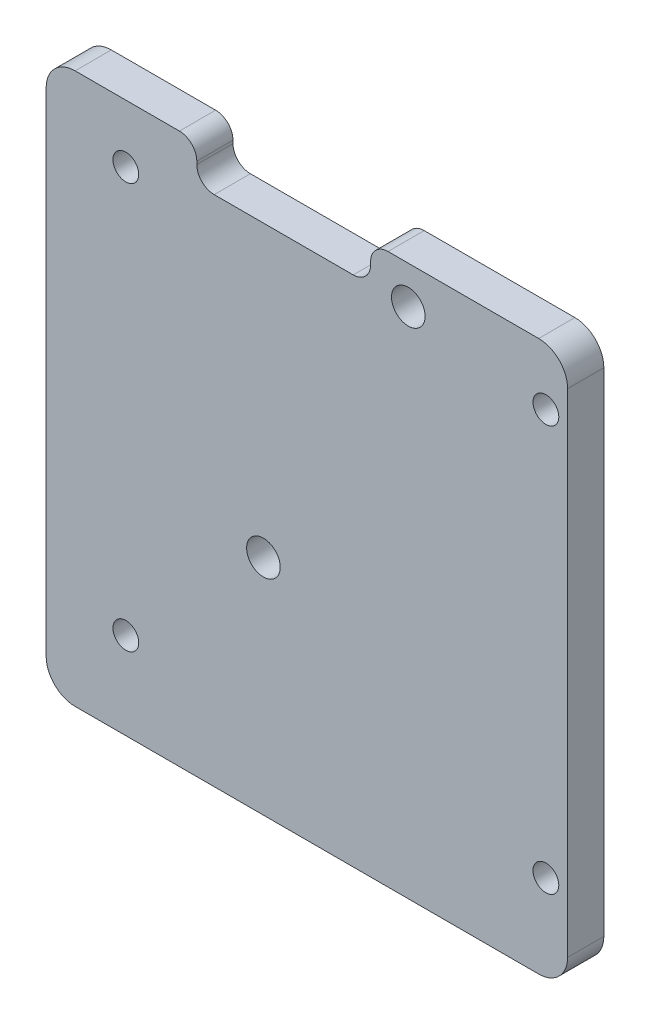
ISO-10303-21;
HEADER;
FILE_DESCRIPTION(('STEP AP214'),'2;1');
FILE_NAME('part.step','',(''),(''),'','','');
FILE_SCHEMA(('AUTOMOTIVE_DESIGN { 1 0 10303 214 1 1 1 1 }'));
ENDSEC;
DATA;
#1=APPLICATION_CONTEXT('core data for automotive mechanical design processes');
#2=APPLICATION_PROTOCOL_DEFINITION('international standard','automotive_design',2000,#1);
#3=PRODUCT_CONTEXT('',#1,'mechanical');
#4=PRODUCT('Part','Part','',(#3));
#5=PRODUCT_RELATED_PRODUCT_CATEGORY('part','',(#4));
#6=PRODUCT_DEFINITION_FORMATION('','',#4);
#7=PRODUCT_DEFINITION_CONTEXT('part definition',#1,'design');
#8=PRODUCT_DEFINITION('design','',#6,#7);
#9=PRODUCT_DEFINITION_SHAPE('','',#8);
#10=(LENGTH_UNIT() NAMED_UNIT(*) SI_UNIT(.MILLI.,.METRE.));
#11=(NAMED_UNIT(*) PLANE_ANGLE_UNIT() SI_UNIT($,.RADIAN.));
#12=(NAMED_UNIT(*) SI_UNIT($,.STERADIAN.) SOLID_ANGLE_UNIT());
#13=UNCERTAINTY_MEASURE_WITH_UNIT(LENGTH_MEASURE(1.E-05),#10,'distance_accuracy_value','');
#14=(GEOMETRIC_REPRESENTATION_CONTEXT(3) GLOBAL_UNCERTAINTY_ASSIGNED_CONTEXT((#13)) GLOBAL_UNIT_ASSIGNED_CONTEXT((#10,
#11,#12)) REPRESENTATION_CONTEXT('',''));
#15=CARTESIAN_POINT('',(0.,0.,0.));
#16=DIRECTION('',(0.,0.,1.));
#17=DIRECTION('',(1.,0.,0.));
#18=AXIS2_PLACEMENT_3D('',#15,#16,#17);
#19=CARTESIAN_POINT('',(-22.86,24.13,3.175));
#20=DIRECTION('',(0.,-1.,0.));
#21=DIRECTION('',(0.,0.,-1.));
#22=AXIS2_PLACEMENT_3D('',#19,#20,#21);
#23=PLANE('',#22);
#24=DIRECTION('',(-1.,0.,0.));
#25=VECTOR('',#24,1.);
#26=CARTESIAN_POINT('',(-22.86,24.13,0.));
#27=LINE('',#26,#25);
#28=CARTESIAN_POINT('',(-11.176,24.13,0.));
#29=VERTEX_POINT('',#28);
#30=CARTESIAN_POINT('',(-20.32,24.13,0.));
#31=VERTEX_POINT('',#30);
#32=EDGE_CURVE('E167',#29,#31,#27,.T.);
#33=ORIENTED_EDGE('',*,*,#32,.T.);
#34=DIRECTION('',(0.,0.,-1.));
#35=VECTOR('',#34,1.);
#36=CARTESIAN_POINT('',(-20.32,24.13,3.175));
#37=LINE('',#36,#35);
#38=CARTESIAN_POINT('',(-20.32,24.13,3.175));
#39=VERTEX_POINT('',#38);
#40=EDGE_CURVE('E50',#31,#39,#37,.F.);
#41=ORIENTED_EDGE('',*,*,#40,.T.);
#42=DIRECTION('',(-1.,0.,0.));
#43=VECTOR('',#42,1.);
#44=CARTESIAN_POINT('',(-22.86,24.13,3.175));
#45=LINE('',#44,#43);
#46=CARTESIAN_POINT('',(-11.176,24.13,3.175));
#47=VERTEX_POINT('',#46);
#48=EDGE_CURVE('E284',#47,#39,#45,.T.);
#49=ORIENTED_EDGE('',*,*,#48,.F.);
#50=DIRECTION('',(0.,0.,-1.));
#51=VECTOR('',#50,1.);
#52=CARTESIAN_POINT('',(-11.176,24.13,3.175));
#53=LINE('',#52,#51);
#54=EDGE_CURVE('E180',#47,#29,#53,.T.);
#55=ORIENTED_EDGE('',*,*,#54,.T.);
#56=EDGE_LOOP('',(#33,#41,#49,#55));
#57=FACE_BOUND('',#56,.T.);
#58=ADVANCED_FACE('F41',(#57),#23,.F.);
#59=CARTESIAN_POINT('',(22.86,24.13,3.175));
#60=DIRECTION('',(-1.,0.,0.));
#61=DIRECTION('',(0.,-1.,0.));
#62=AXIS2_PLACEMENT_3D('',#59,#60,#61);
#63=PLANE('',#62);
#64=DIRECTION('',(0.,1.,0.));
#65=VECTOR('',#64,1.);
#66=CARTESIAN_POINT('',(22.86,24.13,3.175));
#67=LINE('',#66,#65);
#68=CARTESIAN_POINT('',(22.86,-21.59,3.175));
#69=VERTEX_POINT('',#68);
#70=CARTESIAN_POINT('',(22.86,21.59,3.175));
#71=VERTEX_POINT('',#70);
#72=EDGE_CURVE('E295',#69,#71,#67,.T.);
#73=ORIENTED_EDGE('',*,*,#72,.F.);
#74=DIRECTION('',(0.,0.,-1.));
#75=VECTOR('',#74,1.);
#76=CARTESIAN_POINT('',(22.86,-21.59,3.175));
#77=LINE('',#76,#75);
#78=CARTESIAN_POINT('',(22.86,-21.59,0.));
#79=VERTEX_POINT('',#78);
#80=EDGE_CURVE('E240',#69,#79,#77,.T.);
#81=ORIENTED_EDGE('',*,*,#80,.T.);
#82=DIRECTION('',(0.,1.,0.));
#83=VECTOR('',#82,1.);
#84=CARTESIAN_POINT('',(22.86,24.13,0.));
#85=LINE('',#84,#83);
#86=CARTESIAN_POINT('',(22.86,21.59,0.));
#87=VERTEX_POINT('',#86);
#88=EDGE_CURVE('E309',#79,#87,#85,.T.);
#89=ORIENTED_EDGE('',*,*,#88,.T.);
#90=DIRECTION('',(0.,0.,-1.));
#91=VECTOR('',#90,1.);
#92=CARTESIAN_POINT('',(22.86,21.59,3.175));
#93=LINE('',#92,#91);
#94=EDGE_CURVE('E237',#87,#71,#93,.F.);
#95=ORIENTED_EDGE('',*,*,#94,.T.);
#96=EDGE_LOOP('',(#73,#81,#89,#95));
#97=FACE_BOUND('',#96,.T.);
#98=ADVANCED_FACE('F419',(#97),#63,.F.);
#99=CARTESIAN_POINT('',(20.32,24.13,3.175));
#100=VERTEX_POINT('',#99);
#101=CARTESIAN_POINT('',(7.11200000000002,24.13,3.175));
#102=VERTEX_POINT('',#101);
#103=EDGE_CURVE('E294',#100,#102,#45,.T.);
#104=ORIENTED_EDGE('',*,*,#103,.F.);
#105=DIRECTION('',(0.,0.,-1.));
#106=VECTOR('',#105,1.);
#107=CARTESIAN_POINT('',(20.32,24.13,3.175));
#108=LINE('',#107,#106);
#109=CARTESIAN_POINT('',(20.32,24.13,0.));
#110=VERTEX_POINT('',#109);
#111=EDGE_CURVE('E11',#100,#110,#108,.T.);
#112=ORIENTED_EDGE('',*,*,#111,.T.);
#113=CARTESIAN_POINT('',(7.11200000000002,24.13,0.));
#114=VERTEX_POINT('',#113);
#115=EDGE_CURVE('E157',#110,#114,#27,.T.);
#116=ORIENTED_EDGE('',*,*,#115,.T.);
#117=DIRECTION('',(0.,0.,1.));
#118=VECTOR('',#117,1.);
#119=CARTESIAN_POINT('',(7.11200000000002,24.13,3.175));
#120=LINE('',#119,#118);
#121=EDGE_CURVE('E162',#114,#102,#120,.T.);
#122=ORIENTED_EDGE('',*,*,#121,.T.);
#123=EDGE_LOOP('',(#104,#112,#116,#122));
#124=FACE_BOUND('',#123,.T.);
#125=ADVANCED_FACE('F160',(#124),#23,.F.);
#126=CARTESIAN_POINT('',(-22.86,24.13,3.175));
#127=DIRECTION('',(1.,0.,0.));
#128=DIRECTION('',(0.,1.,0.));
#129=AXIS2_PLACEMENT_3D('',#126,#127,#128);
#130=PLANE('',#129);
#131=DIRECTION('',(0.,-1.,0.));
#132=VECTOR('',#131,1.);
#133=CARTESIAN_POINT('',(-22.86,24.13,0.));
#134=LINE('',#133,#132);
#135=CARTESIAN_POINT('',(-22.86,21.59,0.));
#136=VERTEX_POINT('',#135);
#137=CARTESIAN_POINT('',(-22.86,-21.59,0.));
#138=VERTEX_POINT('',#137);
#139=EDGE_CURVE('E166',#136,#138,#134,.T.);
#140=ORIENTED_EDGE('',*,*,#139,.T.);
#141=DIRECTION('',(0.,0.,-1.));
#142=VECTOR('',#141,1.);
#143=CARTESIAN_POINT('',(-22.86,-21.59,3.175));
#144=LINE('',#143,#142);
#145=CARTESIAN_POINT('',(-22.86,-21.59,3.175));
#146=VERTEX_POINT('',#145);
#147=EDGE_CURVE('E57',#138,#146,#144,.F.);
#148=ORIENTED_EDGE('',*,*,#147,.T.);
#149=DIRECTION('',(0.,-1.,0.));
#150=VECTOR('',#149,1.);
#151=CARTESIAN_POINT('',(-22.86,24.13,3.175));
#152=LINE('',#151,#150);
#153=CARTESIAN_POINT('',(-22.86,21.59,3.175));
#154=VERTEX_POINT('',#153);
#155=EDGE_CURVE('E301',#154,#146,#152,.T.);
#156=ORIENTED_EDGE('',*,*,#155,.F.);
#157=DIRECTION('',(0.,0.,-1.));
#158=VECTOR('',#157,1.);
#159=CARTESIAN_POINT('',(-22.86,21.59,3.175));
#160=LINE('',#159,#158);
#161=EDGE_CURVE('E274',#154,#136,#160,.T.);
#162=ORIENTED_EDGE('',*,*,#161,.T.);
#163=EDGE_LOOP('',(#140,#148,#156,#162));
#164=FACE_BOUND('',#163,.T.);
#165=ADVANCED_FACE('F300',(#164),#130,.F.);
#166=CARTESIAN_POINT('',(-22.86,-24.13,3.175));
#167=DIRECTION('',(0.,1.,0.));
#168=DIRECTION('',(0.,0.,1.));
#169=AXIS2_PLACEMENT_3D('',#166,#167,#168);
#170=PLANE('',#169);
#171=DIRECTION('',(1.,0.,0.));
#172=VECTOR('',#171,1.);
#173=CARTESIAN_POINT('',(-22.86,-24.13,0.));
#174=LINE('',#173,#172);
#175=CARTESIAN_POINT('',(-20.32,-24.13,0.));
#176=VERTEX_POINT('',#175);
#177=CARTESIAN_POINT('',(20.32,-24.13,0.));
#178=VERTEX_POINT('',#177);
#179=EDGE_CURVE('E304',#176,#178,#174,.T.);
#180=ORIENTED_EDGE('',*,*,#179,.T.);
#181=DIRECTION('',(0.,0.,-1.));
#182=VECTOR('',#181,1.);
#183=CARTESIAN_POINT('',(20.32,-24.13,3.175));
#184=LINE('',#183,#182);
#185=CARTESIAN_POINT('',(20.32,-24.13,3.175));
#186=VERTEX_POINT('',#185);
#187=EDGE_CURVE('E260',#178,#186,#184,.F.);
#188=ORIENTED_EDGE('',*,*,#187,.T.);
#189=DIRECTION('',(1.,0.,0.));
#190=VECTOR('',#189,1.);
#191=CARTESIAN_POINT('',(-22.86,-24.13,3.175));
#192=LINE('',#191,#190);
#193=CARTESIAN_POINT('',(-20.32,-24.13,3.175));
#194=VERTEX_POINT('',#193);
#195=EDGE_CURVE('E194',#194,#186,#192,.T.);
#196=ORIENTED_EDGE('',*,*,#195,.F.);
#197=DIRECTION('',(0.,0.,-1.));
#198=VECTOR('',#197,1.);
#199=CARTESIAN_POINT('',(-20.32,-24.13,3.175));
#200=LINE('',#199,#198);
#201=EDGE_CURVE('E256',#194,#176,#200,.T.);
#202=ORIENTED_EDGE('',*,*,#201,.T.);
#203=EDGE_LOOP('',(#180,#188,#196,#202));
#204=FACE_BOUND('',#203,.T.);
#205=ADVANCED_FACE('F392',(#204),#170,.F.);
#206=CARTESIAN_POINT('',(0.,0.,3.175));
#207=DIRECTION('',(0.,0.,1.));
#208=DIRECTION('',(1.,0.,0.));
#209=AXIS2_PLACEMENT_3D('',#206,#207,#208);
#210=PLANE('',#209);
#211=CARTESIAN_POINT('',(-15.875,19.05,3.175));
#212=DIRECTION('',(0.,0.,1.));
#213=DIRECTION('',(1.,0.,0.));
#214=AXIS2_PLACEMENT_3D('',#211,#212,#213);
#215=CIRCLE('',#214,1.13029999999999);
#216=CARTESIAN_POINT('',(-14.7447,19.05,3.175));
#217=VERTEX_POINT('',#216);
#218=EDGE_CURVE('E383',#217,#217,#215,.T.);
#219=ORIENTED_EDGE('',*,*,#218,.F.);
#220=EDGE_LOOP('',(#219));
#221=FACE_BOUND('',#220,.T.);
#222=CARTESIAN_POINT('',(20.955,19.05,3.175));
#223=DIRECTION('',(0.,0.,1.));
#224=DIRECTION('',(1.,0.,0.));
#225=AXIS2_PLACEMENT_3D('',#222,#223,#224);
#226=CIRCLE('',#225,1.13029999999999);
#227=CARTESIAN_POINT('',(22.0853,19.05,3.175));
#228=VERTEX_POINT('',#227);
#229=EDGE_CURVE('E375',#228,#228,#226,.T.);
#230=ORIENTED_EDGE('',*,*,#229,.F.);
#231=EDGE_LOOP('',(#230));
#232=FACE_BOUND('',#231,.T.);
#233=CARTESIAN_POINT('',(-15.875,-16.51,3.175));
#234=DIRECTION('',(0.,0.,1.));
#235=DIRECTION('',(1.,0.,0.));
#236=AXIS2_PLACEMENT_3D('',#233,#234,#235);
#237=CIRCLE('',#236,1.13029999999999);
#238=CARTESIAN_POINT('',(-14.7447,-16.51,3.175));
#239=VERTEX_POINT('',#238);
#240=EDGE_CURVE('E367',#239,#239,#237,.T.);
#241=ORIENTED_EDGE('',*,*,#240,.F.);
#242=EDGE_LOOP('',(#241));
#243=FACE_BOUND('',#242,.T.);
#244=CARTESIAN_POINT('',(20.955,-16.51,3.175));
#245=DIRECTION('',(0.,0.,1.));
#246=DIRECTION('',(1.,0.,0.));
#247=AXIS2_PLACEMENT_3D('',#244,#245,#246);
#248=CIRCLE('',#247,1.13029999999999);
#249=CARTESIAN_POINT('',(22.0853,-16.51,3.175));
#250=VERTEX_POINT('',#249);
#251=EDGE_CURVE('E359',#250,#250,#248,.T.);
#252=ORIENTED_EDGE('',*,*,#251,.F.);
#253=EDGE_LOOP('',(#252));
#254=FACE_BOUND('',#253,.T.);
#255=ORIENTED_EDGE('',*,*,#195,.T.);
#256=CARTESIAN_POINT('',(20.32,-21.59,3.175));
#257=DIRECTION('',(0.,0.,1.));
#258=DIRECTION('',(1.,0.,0.));
#259=AXIS2_PLACEMENT_3D('',#256,#257,#258);
#260=CIRCLE('',#259,2.54);
#261=EDGE_CURVE('E271',#186,#69,#260,.T.);
#262=ORIENTED_EDGE('',*,*,#261,.T.);
#263=ORIENTED_EDGE('',*,*,#72,.T.);
#264=CARTESIAN_POINT('',(20.32,21.59,3.175));
#265=DIRECTION('',(0.,0.,1.));
#266=DIRECTION('',(1.,0.,0.));
#267=AXIS2_PLACEMENT_3D('',#264,#265,#266);
#268=CIRCLE('',#267,2.54);
#269=EDGE_CURVE('E263',#71,#100,#268,.T.);
#270=ORIENTED_EDGE('',*,*,#269,.T.);
#271=ORIENTED_EDGE('',*,*,#103,.T.);
#272=CARTESIAN_POINT('',(7.11200000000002,22.606,3.175));
#273=DIRECTION('',(0.,0.,1.));
#274=DIRECTION('',(1.,0.,0.));
#275=AXIS2_PLACEMENT_3D('',#272,#273,#274);
#276=CIRCLE('',#275,1.524);
#277=CARTESIAN_POINT('',(5.58800000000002,22.606,3.175));
#278=VERTEX_POINT('',#277);
#279=EDGE_CURVE('E185',#102,#278,#276,.T.);
#280=ORIENTED_EDGE('',*,*,#279,.T.);
#281=DIRECTION('',(0.,1.,0.));
#282=VECTOR('',#281,1.);
#283=CARTESIAN_POINT('',(5.58800000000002,27.432,3.175));
#284=LINE('',#283,#282);
#285=CARTESIAN_POINT('',(5.58800000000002,22.352,3.175));
#286=VERTEX_POINT('',#285);
#287=EDGE_CURVE('E337',#286,#278,#284,.T.);
#288=ORIENTED_EDGE('',*,*,#287,.F.);
#289=CARTESIAN_POINT('',(4.06400000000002,22.352,3.175));
#290=DIRECTION('',(0.,0.,1.));
#291=DIRECTION('',(1.,0.,0.));
#292=AXIS2_PLACEMENT_3D('',#289,#290,#291);
#293=CIRCLE('',#292,1.524);
#294=CARTESIAN_POINT('',(4.06400000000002,20.828,3.175));
#295=VERTEX_POINT('',#294);
#296=EDGE_CURVE('E231',#286,#295,#293,.F.);
#297=ORIENTED_EDGE('',*,*,#296,.T.);
#298=DIRECTION('',(1.,0.,0.));
#299=VECTOR('',#298,1.);
#300=CARTESIAN_POINT('',(5.58800000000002,20.828,3.175));
#301=LINE('',#300,#299);
#302=CARTESIAN_POINT('',(-8.12799999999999,20.828,3.175));
#303=VERTEX_POINT('',#302);
#304=EDGE_CURVE('E342',#303,#295,#301,.T.);
#305=ORIENTED_EDGE('',*,*,#304,.F.);
#306=CARTESIAN_POINT('',(-8.12799999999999,22.352,3.175));
#307=DIRECTION('',(0.,0.,1.));
#308=DIRECTION('',(1.,0.,0.));
#309=AXIS2_PLACEMENT_3D('',#306,#307,#308);
#310=CIRCLE('',#309,1.524);
#311=CARTESIAN_POINT('',(-9.65199999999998,22.352,3.175));
#312=VERTEX_POINT('',#311);
#313=EDGE_CURVE('E225',#303,#312,#310,.F.);
#314=ORIENTED_EDGE('',*,*,#313,.T.);
#315=DIRECTION('',(0.,-1.,0.));
#316=VECTOR('',#315,1.);
#317=CARTESIAN_POINT('',(-9.65199999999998,27.432,3.175));
#318=LINE('',#317,#316);
#319=CARTESIAN_POINT('',(-9.65199999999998,22.606,3.175));
#320=VERTEX_POINT('',#319);
#321=EDGE_CURVE('E346',#320,#312,#318,.T.);
#322=ORIENTED_EDGE('',*,*,#321,.F.);
#323=CARTESIAN_POINT('',(-11.176,22.606,3.175));
#324=DIRECTION('',(0.,0.,1.));
#325=DIRECTION('',(1.,0.,0.));
#326=AXIS2_PLACEMENT_3D('',#323,#324,#325);
#327=CIRCLE('',#326,1.524);
#328=EDGE_CURVE('E187',#320,#47,#327,.T.);
#329=ORIENTED_EDGE('',*,*,#328,.T.);
#330=ORIENTED_EDGE('',*,*,#48,.T.);
#331=CARTESIAN_POINT('',(-20.32,21.59,3.175));
#332=DIRECTION('',(0.,0.,1.));
#333=DIRECTION('',(1.,0.,0.));
#334=AXIS2_PLACEMENT_3D('',#331,#332,#333);
#335=CIRCLE('',#334,2.54);
#336=EDGE_CURVE('E64',#39,#154,#335,.T.);
#337=ORIENTED_EDGE('',*,*,#336,.T.);
#338=ORIENTED_EDGE('',*,*,#155,.T.);
#339=CARTESIAN_POINT('',(-20.32,-21.59,3.175));
#340=DIRECTION('',(0.,0.,1.));
#341=DIRECTION('',(1.,0.,0.));
#342=AXIS2_PLACEMENT_3D('',#339,#340,#341);
#343=CIRCLE('',#342,2.54);
#344=EDGE_CURVE('E268',#146,#194,#343,.T.);
#345=ORIENTED_EDGE('',*,*,#344,.T.);
#346=EDGE_LOOP('',(#255,#262,#263,#270,#271,#280,#288,#297,#305,#314,#322,#329,#330,#337,#338,#345));
#347=FACE_BOUND('',#346,.T.);
#348=CARTESIAN_POINT('',(8.89,20.828,3.175));
#349=DIRECTION('',(0.,0.,1.));
#350=DIRECTION('',(1.,0.,0.));
#351=AXIS2_PLACEMENT_3D('',#348,#349,#350);
#352=CIRCLE('',#351,1.4732);
#353=CARTESIAN_POINT('',(10.3632,20.828,3.175));
#354=VERTEX_POINT('',#353);
#355=EDGE_CURVE('E333',#354,#354,#352,.T.);
#356=ORIENTED_EDGE('',*,*,#355,.F.);
#357=EDGE_LOOP('',(#356));
#358=FACE_BOUND('',#357,.T.);
#359=CARTESIAN_POINT('',(-3.80999999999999,-4.572,3.175));
#360=DIRECTION('',(0.,0.,1.));
#361=DIRECTION('',(1.,0.,0.));
#362=AXIS2_PLACEMENT_3D('',#359,#360,#361);
#363=CIRCLE('',#362,1.4732);
#364=CARTESIAN_POINT('',(-2.33679999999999,-4.572,3.175));
#365=VERTEX_POINT('',#364);
#366=EDGE_CURVE('E325',#365,#365,#363,.T.);
#367=ORIENTED_EDGE('',*,*,#366,.F.);
#368=EDGE_LOOP('',(#367));
#369=FACE_BOUND('',#368,.T.);
#370=ADVANCED_FACE('F289',(#221,#232,#243,#254,#347,#358,#369),#210,.T.);
#371=CARTESIAN_POINT('',(0.,0.,0.));
#372=DIRECTION('',(0.,0.,1.));
#373=DIRECTION('',(1.,0.,0.));
#374=AXIS2_PLACEMENT_3D('',#371,#372,#373);
#375=PLANE('',#374);
#376=CARTESIAN_POINT('',(-15.875,19.05,0.));
#377=DIRECTION('',(0.,0.,1.));
#378=DIRECTION('',(1.,0.,0.));
#379=AXIS2_PLACEMENT_3D('',#376,#377,#378);
#380=CIRCLE('',#379,1.1303);
#381=CARTESIAN_POINT('',(-14.7447,19.05,0.));
#382=VERTEX_POINT('',#381);
#383=EDGE_CURVE('E379',#382,#382,#380,.T.);
#384=ORIENTED_EDGE('',*,*,#383,.T.);
#385=EDGE_LOOP('',(#384));
#386=FACE_BOUND('',#385,.T.);
#387=CARTESIAN_POINT('',(20.955,19.05,0.));
#388=DIRECTION('',(0.,0.,1.));
#389=DIRECTION('',(1.,0.,0.));
#390=AXIS2_PLACEMENT_3D('',#387,#388,#389);
#391=CIRCLE('',#390,1.1303);
#392=CARTESIAN_POINT('',(22.0853,19.05,0.));
#393=VERTEX_POINT('',#392);
#394=EDGE_CURVE('E371',#393,#393,#391,.T.);
#395=ORIENTED_EDGE('',*,*,#394,.T.);
#396=EDGE_LOOP('',(#395));
#397=FACE_BOUND('',#396,.T.);
#398=CARTESIAN_POINT('',(-15.875,-16.51,0.));
#399=DIRECTION('',(0.,0.,1.));
#400=DIRECTION('',(1.,0.,0.));
#401=AXIS2_PLACEMENT_3D('',#398,#399,#400);
#402=CIRCLE('',#401,1.1303);
#403=CARTESIAN_POINT('',(-14.7447,-16.51,0.));
#404=VERTEX_POINT('',#403);
#405=EDGE_CURVE('E363',#404,#404,#402,.T.);
#406=ORIENTED_EDGE('',*,*,#405,.T.);
#407=EDGE_LOOP('',(#406));
#408=FACE_BOUND('',#407,.T.);
#409=CARTESIAN_POINT('',(20.955,-16.51,0.));
#410=DIRECTION('',(0.,0.,1.));
#411=DIRECTION('',(1.,0.,0.));
#412=AXIS2_PLACEMENT_3D('',#409,#410,#411);
#413=CIRCLE('',#412,1.1303);
#414=CARTESIAN_POINT('',(22.0853,-16.51,0.));
#415=VERTEX_POINT('',#414);
#416=EDGE_CURVE('E350',#415,#415,#413,.T.);
#417=ORIENTED_EDGE('',*,*,#416,.T.);
#418=EDGE_LOOP('',(#417));
#419=FACE_BOUND('',#418,.T.);
#420=ORIENTED_EDGE('',*,*,#88,.F.);
#421=CARTESIAN_POINT('',(20.32,-21.59,0.));
#422=DIRECTION('',(0.,0.,1.));
#423=DIRECTION('',(1.,0.,0.));
#424=AXIS2_PLACEMENT_3D('',#421,#422,#423);
#425=CIRCLE('',#424,2.54);
#426=EDGE_CURVE('E253',#79,#178,#425,.F.);
#427=ORIENTED_EDGE('',*,*,#426,.T.);
#428=ORIENTED_EDGE('',*,*,#179,.F.);
#429=CARTESIAN_POINT('',(-20.32,-21.59,0.));
#430=DIRECTION('',(0.,0.,1.));
#431=DIRECTION('',(1.,0.,0.));
#432=AXIS2_PLACEMENT_3D('',#429,#430,#431);
#433=CIRCLE('',#432,2.54);
#434=EDGE_CURVE('E250',#176,#138,#433,.F.);
#435=ORIENTED_EDGE('',*,*,#434,.T.);
#436=ORIENTED_EDGE('',*,*,#139,.F.);
#437=CARTESIAN_POINT('',(-20.32,21.59,0.));
#438=DIRECTION('',(0.,0.,1.));
#439=DIRECTION('',(1.,0.,0.));
#440=AXIS2_PLACEMENT_3D('',#437,#438,#439);
#441=CIRCLE('',#440,2.54);
#442=EDGE_CURVE('E247',#136,#31,#441,.F.);
#443=ORIENTED_EDGE('',*,*,#442,.T.);
#444=ORIENTED_EDGE('',*,*,#32,.F.);
#445=CARTESIAN_POINT('',(-11.176,22.606,0.));
#446=DIRECTION('',(0.,0.,1.));
#447=DIRECTION('',(1.,0.,0.));
#448=AXIS2_PLACEMENT_3D('',#445,#446,#447);
#449=CIRCLE('',#448,1.524);
#450=CARTESIAN_POINT('',(-9.65199999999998,22.606,0.));
#451=VERTEX_POINT('',#450);
#452=EDGE_CURVE('E181',#29,#451,#449,.F.);
#453=ORIENTED_EDGE('',*,*,#452,.T.);
#454=DIRECTION('',(0.,-1.,0.));
#455=VECTOR('',#454,1.);
#456=CARTESIAN_POINT('',(-9.65199999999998,0.,0.));
#457=LINE('',#456,#455);
#458=CARTESIAN_POINT('',(-9.65199999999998,22.352,0.));
#459=VERTEX_POINT('',#458);
#460=EDGE_CURVE('E188',#451,#459,#457,.T.);
#461=ORIENTED_EDGE('',*,*,#460,.T.);
#462=CARTESIAN_POINT('',(-8.12799999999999,22.352,0.));
#463=DIRECTION('',(0.,0.,1.));
#464=DIRECTION('',(1.,0.,0.));
#465=AXIS2_PLACEMENT_3D('',#462,#463,#464);
#466=CIRCLE('',#465,1.524);
#467=CARTESIAN_POINT('',(-8.12799999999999,20.828,0.));
#468=VERTEX_POINT('',#467);
#469=EDGE_CURVE('E228',#459,#468,#466,.T.);
#470=ORIENTED_EDGE('',*,*,#469,.T.);
#471=DIRECTION('',(1.,0.,0.));
#472=VECTOR('',#471,1.);
#473=CARTESIAN_POINT('',(5.58800000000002,20.828,0.));
#474=LINE('',#473,#472);
#475=CARTESIAN_POINT('',(4.06400000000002,20.828,0.));
#476=VERTEX_POINT('',#475);
#477=EDGE_CURVE('E341',#468,#476,#474,.T.);
#478=ORIENTED_EDGE('',*,*,#477,.T.);
#479=CARTESIAN_POINT('',(4.06400000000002,22.352,0.));
#480=DIRECTION('',(0.,0.,1.));
#481=DIRECTION('',(1.,0.,0.));
#482=AXIS2_PLACEMENT_3D('',#479,#480,#481);
#483=CIRCLE('',#482,1.524);
#484=CARTESIAN_POINT('',(5.58800000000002,22.352,0.));
#485=VERTEX_POINT('',#484);
#486=EDGE_CURVE('E234',#476,#485,#483,.T.);
#487=ORIENTED_EDGE('',*,*,#486,.T.);
#488=DIRECTION('',(0.,1.,0.));
#489=VECTOR('',#488,1.);
#490=CARTESIAN_POINT('',(5.58800000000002,27.432,0.));
#491=LINE('',#490,#489);
#492=CARTESIAN_POINT('',(5.58800000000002,22.606,0.));
#493=VERTEX_POINT('',#492);
#494=EDGE_CURVE('E176',#485,#493,#491,.T.);
#495=ORIENTED_EDGE('',*,*,#494,.T.);
#496=CARTESIAN_POINT('',(7.11200000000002,22.606,0.));
#497=DIRECTION('',(0.,0.,1.));
#498=DIRECTION('',(1.,0.,0.));
#499=AXIS2_PLACEMENT_3D('',#496,#497,#498);
#500=CIRCLE('',#499,1.524);
#501=EDGE_CURVE('E171',#493,#114,#500,.F.);
#502=ORIENTED_EDGE('',*,*,#501,.T.);
#503=ORIENTED_EDGE('',*,*,#115,.F.);
#504=CARTESIAN_POINT('',(20.32,21.59,0.));
#505=DIRECTION('',(0.,0.,1.));
#506=DIRECTION('',(1.,0.,0.));
#507=AXIS2_PLACEMENT_3D('',#504,#505,#506);
#508=CIRCLE('',#507,2.54);
#509=EDGE_CURVE('E244',#110,#87,#508,.F.);
#510=ORIENTED_EDGE('',*,*,#509,.T.);
#511=EDGE_LOOP('',(#420,#427,#428,#435,#436,#443,#444,#453,#461,#470,#478,#487,#495,#502,#503,#510));
#512=FACE_BOUND('',#511,.T.);
#513=CARTESIAN_POINT('',(8.89,20.828,0.));
#514=DIRECTION('',(0.,0.,1.));
#515=DIRECTION('',(1.,0.,0.));
#516=AXIS2_PLACEMENT_3D('',#513,#514,#515);
#517=CIRCLE('',#516,1.4732);
#518=CARTESIAN_POINT('',(10.3632,20.828,0.));
#519=VERTEX_POINT('',#518);
#520=EDGE_CURVE('E329',#519,#519,#517,.T.);
#521=ORIENTED_EDGE('',*,*,#520,.T.);
#522=EDGE_LOOP('',(#521));
#523=FACE_BOUND('',#522,.T.);
#524=CARTESIAN_POINT('',(-3.80999999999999,-4.572,0.));
#525=DIRECTION('',(0.,0.,1.));
#526=DIRECTION('',(1.,0.,0.));
#527=AXIS2_PLACEMENT_3D('',#524,#525,#526);
#528=CIRCLE('',#527,1.4732);
#529=CARTESIAN_POINT('',(-2.33679999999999,-4.572,0.));
#530=VERTEX_POINT('',#529);
#531=EDGE_CURVE('E313',#530,#530,#528,.T.);
#532=ORIENTED_EDGE('',*,*,#531,.T.);
#533=EDGE_LOOP('',(#532));
#534=FACE_BOUND('',#533,.T.);
#535=ADVANCED_FACE('F173',(#386,#397,#408,#419,#512,#523,#534),#375,.F.);
#536=CARTESIAN_POINT('',(-3.80999999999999,-4.572,3.175));
#537=DIRECTION('',(0.,0.,1.));
#538=DIRECTION('',(1.,0.,0.));
#539=AXIS2_PLACEMENT_3D('',#536,#537,#538);
#540=CYLINDRICAL_SURFACE('',#539,1.4732);
#541=ORIENTED_EDGE('',*,*,#531,.F.);
#542=EDGE_LOOP('',(#541));
#543=FACE_BOUND('',#542,.T.);
#544=ORIENTED_EDGE('',*,*,#366,.T.);
#545=EDGE_LOOP('',(#544));
#546=FACE_BOUND('',#545,.T.);
#547=ADVANCED_FACE('F438',(#543,#546),#540,.F.);
#548=CARTESIAN_POINT('',(8.89,20.828,3.175));
#549=DIRECTION('',(0.,0.,1.));
#550=DIRECTION('',(1.,0.,0.));
#551=AXIS2_PLACEMENT_3D('',#548,#549,#550);
#552=CYLINDRICAL_SURFACE('',#551,1.4732);
#553=ORIENTED_EDGE('',*,*,#520,.F.);
#554=EDGE_LOOP('',(#553));
#555=FACE_BOUND('',#554,.T.);
#556=ORIENTED_EDGE('',*,*,#355,.T.);
#557=EDGE_LOOP('',(#556));
#558=FACE_BOUND('',#557,.T.);
#559=ADVANCED_FACE('F443',(#555,#558),#552,.F.);
#560=CARTESIAN_POINT('',(-9.65199999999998,27.432,0.));
#561=DIRECTION('',(-1.,0.,0.));
#562=DIRECTION('',(0.,0.,1.));
#563=AXIS2_PLACEMENT_3D('',#560,#561,#562);
#564=PLANE('',#563);
#565=ORIENTED_EDGE('',*,*,#460,.F.);
#566=DIRECTION('',(0.,0.,-1.));
#567=VECTOR('',#566,1.);
#568=CARTESIAN_POINT('',(-9.65199999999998,22.606,0.));
#569=LINE('',#568,#567);
#570=EDGE_CURVE('E215',#451,#320,#569,.F.);
#571=ORIENTED_EDGE('',*,*,#570,.T.);
#572=ORIENTED_EDGE('',*,*,#321,.T.);
#573=DIRECTION('',(0.,0.,1.));
#574=VECTOR('',#573,1.);
#575=CARTESIAN_POINT('',(-9.65199999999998,22.352,0.));
#576=LINE('',#575,#574);
#577=EDGE_CURVE('E212',#312,#459,#576,.F.);
#578=ORIENTED_EDGE('',*,*,#577,.T.);
#579=EDGE_LOOP('',(#565,#571,#572,#578));
#580=FACE_BOUND('',#579,.T.);
#581=ADVANCED_FACE('F447',(#580),#564,.F.);
#582=CARTESIAN_POINT('',(5.58800000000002,27.432,0.));
#583=DIRECTION('',(1.,0.,0.));
#584=DIRECTION('',(0.,1.,0.));
#585=AXIS2_PLACEMENT_3D('',#582,#583,#584);
#586=PLANE('',#585);
#587=ORIENTED_EDGE('',*,*,#287,.T.);
#588=DIRECTION('',(0.,0.,1.));
#589=VECTOR('',#588,1.);
#590=CARTESIAN_POINT('',(5.58800000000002,22.606,0.));
#591=LINE('',#590,#589);
#592=EDGE_CURVE('E204',#278,#493,#591,.F.);
#593=ORIENTED_EDGE('',*,*,#592,.T.);
#594=ORIENTED_EDGE('',*,*,#494,.F.);
#595=DIRECTION('',(0.,0.,1.));
#596=VECTOR('',#595,1.);
#597=CARTESIAN_POINT('',(5.58800000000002,22.352,3.175));
#598=LINE('',#597,#596);
#599=EDGE_CURVE('E200',#485,#286,#598,.T.);
#600=ORIENTED_EDGE('',*,*,#599,.T.);
#601=EDGE_LOOP('',(#587,#593,#594,#600));
#602=FACE_BOUND('',#601,.T.);
#603=ADVANCED_FACE('F451',(#602),#586,.F.);
#604=CARTESIAN_POINT('',(5.58800000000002,20.828,0.));
#605=DIRECTION('',(0.,-1.,0.));
#606=DIRECTION('',(1.,0.,0.));
#607=AXIS2_PLACEMENT_3D('',#604,#605,#606);
#608=PLANE('',#607);
#609=ORIENTED_EDGE('',*,*,#477,.F.);
#610=DIRECTION('',(0.,0.,1.));
#611=VECTOR('',#610,1.);
#612=CARTESIAN_POINT('',(-8.12799999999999,20.828,3.175));
#613=LINE('',#612,#611);
#614=EDGE_CURVE('E221',#468,#303,#613,.T.);
#615=ORIENTED_EDGE('',*,*,#614,.T.);
#616=ORIENTED_EDGE('',*,*,#304,.T.);
#617=DIRECTION('',(0.,0.,1.));
#618=VECTOR('',#617,1.);
#619=CARTESIAN_POINT('',(4.06400000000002,20.828,0.));
#620=LINE('',#619,#618);
#621=EDGE_CURVE('E218',#295,#476,#620,.F.);
#622=ORIENTED_EDGE('',*,*,#621,.T.);
#623=EDGE_LOOP('',(#609,#615,#616,#622));
#624=FACE_BOUND('',#623,.T.);
#625=ADVANCED_FACE('F453',(#624),#608,.F.);
#626=CARTESIAN_POINT('',(7.11200000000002,22.606,3.175));
#627=DIRECTION('',(0.,0.,1.));
#628=DIRECTION('',(1.,0.,0.));
#629=AXIS2_PLACEMENT_3D('',#626,#627,#628);
#630=CYLINDRICAL_SURFACE('',#629,1.524);
#631=ORIENTED_EDGE('',*,*,#501,.F.);
#632=ORIENTED_EDGE('',*,*,#592,.F.);
#633=ORIENTED_EDGE('',*,*,#279,.F.);
#634=ORIENTED_EDGE('',*,*,#121,.F.);
#635=EDGE_LOOP('',(#631,#632,#633,#634));
#636=FACE_BOUND('',#635,.T.);
#637=ADVANCED_FACE('F184',(#636),#630,.T.);
#638=CARTESIAN_POINT('',(-11.176,22.606,3.175));
#639=DIRECTION('',(0.,0.,-1.));
#640=DIRECTION('',(-1.,0.,0.));
#641=AXIS2_PLACEMENT_3D('',#638,#639,#640);
#642=CYLINDRICAL_SURFACE('',#641,1.524);
#643=ORIENTED_EDGE('',*,*,#328,.F.);
#644=ORIENTED_EDGE('',*,*,#570,.F.);
#645=ORIENTED_EDGE('',*,*,#452,.F.);
#646=ORIENTED_EDGE('',*,*,#54,.F.);
#647=EDGE_LOOP('',(#643,#644,#645,#646));
#648=FACE_BOUND('',#647,.T.);
#649=ADVANCED_FACE('F487',(#648),#642,.T.);
#650=CARTESIAN_POINT('',(-8.12799999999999,22.352,0.));
#651=DIRECTION('',(0.,0.,-1.));
#652=DIRECTION('',(-1.,0.,0.));
#653=AXIS2_PLACEMENT_3D('',#650,#651,#652);
#654=CYLINDRICAL_SURFACE('',#653,1.524);
#655=ORIENTED_EDGE('',*,*,#469,.F.);
#656=ORIENTED_EDGE('',*,*,#577,.F.);
#657=ORIENTED_EDGE('',*,*,#313,.F.);
#658=ORIENTED_EDGE('',*,*,#614,.F.);
#659=EDGE_LOOP('',(#655,#656,#657,#658));
#660=FACE_BOUND('',#659,.T.);
#661=ADVANCED_FACE('F413',(#660),#654,.F.);
#662=CARTESIAN_POINT('',(4.06400000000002,22.352,0.));
#663=DIRECTION('',(0.,0.,-1.));
#664=DIRECTION('',(-1.,0.,0.));
#665=AXIS2_PLACEMENT_3D('',#662,#663,#664);
#666=CYLINDRICAL_SURFACE('',#665,1.524);
#667=ORIENTED_EDGE('',*,*,#486,.F.);
#668=ORIENTED_EDGE('',*,*,#621,.F.);
#669=ORIENTED_EDGE('',*,*,#296,.F.);
#670=ORIENTED_EDGE('',*,*,#599,.F.);
#671=EDGE_LOOP('',(#667,#668,#669,#670));
#672=FACE_BOUND('',#671,.T.);
#673=ADVANCED_FACE('F403',(#672),#666,.F.);
#674=CARTESIAN_POINT('',(20.955,-16.51,3.175));
#675=DIRECTION('',(0.,0.,1.));
#676=DIRECTION('',(1.,0.,0.));
#677=AXIS2_PLACEMENT_3D('',#674,#675,#676);
#678=CYLINDRICAL_SURFACE('',#677,1.13029999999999);
#679=ORIENTED_EDGE('',*,*,#416,.F.);
#680=EDGE_LOOP('',(#679));
#681=FACE_BOUND('',#680,.T.);
#682=ORIENTED_EDGE('',*,*,#251,.T.);
#683=EDGE_LOOP('',(#682));
#684=FACE_BOUND('',#683,.T.);
#685=ADVANCED_FACE('F400',(#681,#684),#678,.F.);
#686=CARTESIAN_POINT('',(-15.875,-16.51,3.175));
#687=DIRECTION('',(0.,0.,1.));
#688=DIRECTION('',(1.,0.,0.));
#689=AXIS2_PLACEMENT_3D('',#686,#687,#688);
#690=CYLINDRICAL_SURFACE('',#689,1.13029999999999);
#691=ORIENTED_EDGE('',*,*,#405,.F.);
#692=EDGE_LOOP('',(#691));
#693=FACE_BOUND('',#692,.T.);
#694=ORIENTED_EDGE('',*,*,#240,.T.);
#695=EDGE_LOOP('',(#694));
#696=FACE_BOUND('',#695,.T.);
#697=ADVANCED_FACE('F402',(#693,#696),#690,.F.);
#698=CARTESIAN_POINT('',(20.955,19.05,3.175));
#699=DIRECTION('',(0.,0.,1.));
#700=DIRECTION('',(1.,0.,0.));
#701=AXIS2_PLACEMENT_3D('',#698,#699,#700);
#702=CYLINDRICAL_SURFACE('',#701,1.13029999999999);
#703=ORIENTED_EDGE('',*,*,#394,.F.);
#704=EDGE_LOOP('',(#703));
#705=FACE_BOUND('',#704,.T.);
#706=ORIENTED_EDGE('',*,*,#229,.T.);
#707=EDGE_LOOP('',(#706));
#708=FACE_BOUND('',#707,.T.);
#709=ADVANCED_FACE('F410',(#705,#708),#702,.F.);
#710=CARTESIAN_POINT('',(-15.875,19.05,3.175));
#711=DIRECTION('',(0.,0.,1.));
#712=DIRECTION('',(1.,0.,0.));
#713=AXIS2_PLACEMENT_3D('',#710,#711,#712);
#714=CYLINDRICAL_SURFACE('',#713,1.13029999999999);
#715=ORIENTED_EDGE('',*,*,#383,.F.);
#716=EDGE_LOOP('',(#715));
#717=FACE_BOUND('',#716,.T.);
#718=ORIENTED_EDGE('',*,*,#218,.T.);
#719=EDGE_LOOP('',(#718));
#720=FACE_BOUND('',#719,.T.);
#721=ADVANCED_FACE('F388',(#717,#720),#714,.F.);
#722=CARTESIAN_POINT('',(20.32,-21.59,3.175));
#723=DIRECTION('',(0.,0.,-1.));
#724=DIRECTION('',(-1.,0.,0.));
#725=AXIS2_PLACEMENT_3D('',#722,#723,#724);
#726=CYLINDRICAL_SURFACE('',#725,2.54);
#727=ORIENTED_EDGE('',*,*,#261,.F.);
#728=ORIENTED_EDGE('',*,*,#187,.F.);
#729=ORIENTED_EDGE('',*,*,#426,.F.);
#730=ORIENTED_EDGE('',*,*,#80,.F.);
#731=EDGE_LOOP('',(#727,#728,#729,#730));
#732=FACE_BOUND('',#731,.T.);
#733=ADVANCED_FACE('F470',(#732),#726,.T.);
#734=CARTESIAN_POINT('',(-20.32,-21.59,3.175));
#735=DIRECTION('',(0.,0.,-1.));
#736=DIRECTION('',(-1.,0.,0.));
#737=AXIS2_PLACEMENT_3D('',#734,#735,#736);
#738=CYLINDRICAL_SURFACE('',#737,2.54);
#739=ORIENTED_EDGE('',*,*,#344,.F.);
#740=ORIENTED_EDGE('',*,*,#147,.F.);
#741=ORIENTED_EDGE('',*,*,#434,.F.);
#742=ORIENTED_EDGE('',*,*,#201,.F.);
#743=EDGE_LOOP('',(#739,#740,#741,#742));
#744=FACE_BOUND('',#743,.T.);
#745=ADVANCED_FACE('F476',(#744),#738,.T.);
#746=CARTESIAN_POINT('',(-20.32,21.59,3.175));
#747=DIRECTION('',(0.,0.,-1.));
#748=DIRECTION('',(-1.,0.,0.));
#749=AXIS2_PLACEMENT_3D('',#746,#747,#748);
#750=CYLINDRICAL_SURFACE('',#749,2.54);
#751=ORIENTED_EDGE('',*,*,#336,.F.);
#752=ORIENTED_EDGE('',*,*,#40,.F.);
#753=ORIENTED_EDGE('',*,*,#442,.F.);
#754=ORIENTED_EDGE('',*,*,#161,.F.);
#755=EDGE_LOOP('',(#751,#752,#753,#754));
#756=FACE_BOUND('',#755,.T.);
#757=ADVANCED_FACE('F298',(#756),#750,.T.);
#758=CARTESIAN_POINT('',(20.32,21.59,3.175));
#759=DIRECTION('',(0.,0.,-1.));
#760=DIRECTION('',(-1.,0.,0.));
#761=AXIS2_PLACEMENT_3D('',#758,#759,#760);
#762=CYLINDRICAL_SURFACE('',#761,2.54);
#763=ORIENTED_EDGE('',*,*,#269,.F.);
#764=ORIENTED_EDGE('',*,*,#94,.F.);
#765=ORIENTED_EDGE('',*,*,#509,.F.);
#766=ORIENTED_EDGE('',*,*,#111,.F.);
#767=EDGE_LOOP('',(#763,#764,#765,#766));
#768=FACE_BOUND('',#767,.T.);
#769=ADVANCED_FACE('F43',(#768),#762,.T.);
#770=CLOSED_SHELL('',(#58,#98,#125,#165,#205,#370,#535,#547,#559,#581,#603,#625,#637,#649,#661,
#673,#685,#697,#709,#721,#733,#745,#757,#769));
#771=MANIFOLD_SOLID_BREP('B2',#770);
#772=ADVANCED_BREP_SHAPE_REPRESENTATION('',(#18,#771),#14);
#773=SHAPE_DEFINITION_REPRESENTATION(#9,#772);
ENDSEC;
END-ISO-10303-21;
